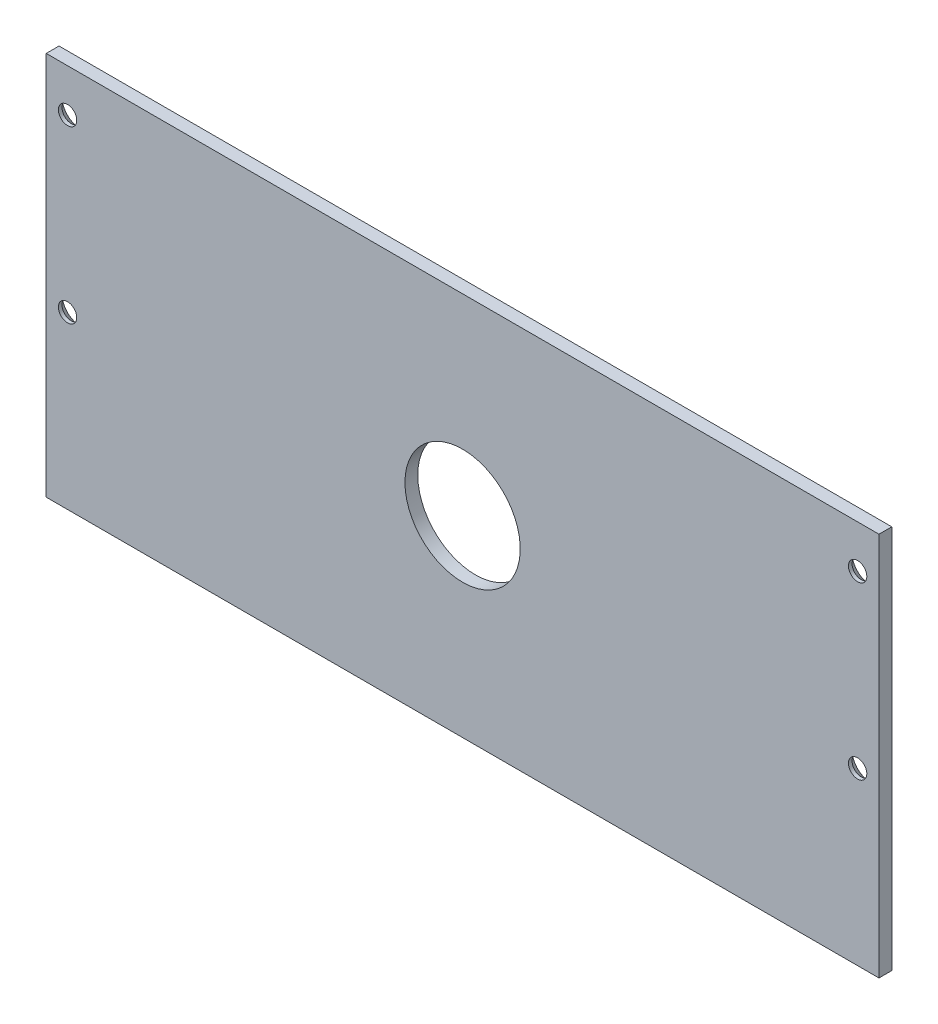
ISO-10303-21;
HEADER;
FILE_DESCRIPTION(('STEP AP214'),'2;1');
FILE_NAME('part.step','',(''),(''),'','','');
FILE_SCHEMA(('AUTOMOTIVE_DESIGN { 1 0 10303 214 1 1 1 1 }'));
ENDSEC;
DATA;
#1=APPLICATION_CONTEXT('core data for automotive mechanical design processes');
#2=APPLICATION_PROTOCOL_DEFINITION('international standard','automotive_design',2000,#1);
#3=PRODUCT_CONTEXT('',#1,'mechanical');
#4=PRODUCT('Part','Part','',(#3));
#5=PRODUCT_RELATED_PRODUCT_CATEGORY('part','',(#4));
#6=PRODUCT_DEFINITION_FORMATION('','',#4);
#7=PRODUCT_DEFINITION_CONTEXT('part definition',#1,'design');
#8=PRODUCT_DEFINITION('design','',#6,#7);
#9=PRODUCT_DEFINITION_SHAPE('','',#8);
#10=(LENGTH_UNIT() NAMED_UNIT(*) SI_UNIT(.MILLI.,.METRE.));
#11=(NAMED_UNIT(*) PLANE_ANGLE_UNIT() SI_UNIT($,.RADIAN.));
#12=(NAMED_UNIT(*) SI_UNIT($,.STERADIAN.) SOLID_ANGLE_UNIT());
#13=UNCERTAINTY_MEASURE_WITH_UNIT(LENGTH_MEASURE(1.E-05),#10,'distance_accuracy_value','');
#14=(GEOMETRIC_REPRESENTATION_CONTEXT(3) GLOBAL_UNCERTAINTY_ASSIGNED_CONTEXT((#13)) GLOBAL_UNIT_ASSIGNED_CONTEXT((#10,
#11,#12)) REPRESENTATION_CONTEXT('',''));
#15=CARTESIAN_POINT('',(0.,0.,0.));
#16=DIRECTION('',(0.,0.,1.));
#17=DIRECTION('',(1.,0.,0.));
#18=AXIS2_PLACEMENT_3D('',#15,#16,#17);
#19=CARTESIAN_POINT('',(-6.10622663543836E-13,5.48339151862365E-09,3.00000000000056));
#20=DIRECTION('',(1.,0.,0.));
#21=DIRECTION('',(0.,0.,-1.));
#22=AXIS2_PLACEMENT_3D('',#19,#20,#21);
#23=PLANE('',#22);
#24=DIRECTION('',(0.,-1.,0.));
#25=VECTOR('',#24,1.);
#26=CARTESIAN_POINT('',(-7.7715611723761E-13,5.4820592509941E-09,4.44089209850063E-13));
#27=LINE('',#26,#25);
#28=CARTESIAN_POINT('',(-4.44089209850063E-13,90.0000000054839,8.88178419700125E-13));
#29=VERTEX_POINT('',#28);
#30=CARTESIAN_POINT('',(-7.7715611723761E-13,5.4820592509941E-09,4.44089209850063E-13));
#31=VERTEX_POINT('',#30);
#32=EDGE_CURVE('E100',#29,#31,#27,.T.);
#33=ORIENTED_EDGE('',*,*,#32,.T.);
#34=DIRECTION('',(0.,0.,-1.));
#35=VECTOR('',#34,1.);
#36=CARTESIAN_POINT('',(-6.10622663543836E-13,5.48339151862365E-09,3.00000000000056));
#37=LINE('',#36,#35);
#38=CARTESIAN_POINT('',(-6.10622663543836E-13,5.48339151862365E-09,3.00000000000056));
#39=VERTEX_POINT('',#38);
#40=EDGE_CURVE('E11',#39,#31,#37,.T.);
#41=ORIENTED_EDGE('',*,*,#40,.F.);
#42=DIRECTION('',(0.,-1.,0.));
#43=VECTOR('',#42,1.);
#44=CARTESIAN_POINT('',(-6.10622663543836E-13,5.48339151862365E-09,3.00000000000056));
#45=LINE('',#44,#43);
#46=CARTESIAN_POINT('',(-2.22044604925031E-13,90.0000000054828,3.00000000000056));
#47=VERTEX_POINT('',#46);
#48=EDGE_CURVE('E88',#47,#39,#45,.T.);
#49=ORIENTED_EDGE('',*,*,#48,.F.);
#50=DIRECTION('',(0.,0.,-1.));
#51=VECTOR('',#50,1.);
#52=CARTESIAN_POINT('',(-2.22044604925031E-13,90.0000000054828,3.00000000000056));
#53=LINE('',#52,#51);
#54=EDGE_CURVE('E96',#47,#29,#53,.T.);
#55=ORIENTED_EDGE('',*,*,#54,.T.);
#56=EDGE_LOOP('',(#33,#41,#49,#55));
#57=FACE_BOUND('',#56,.T.);
#58=ADVANCED_FACE('F36',(#57),#23,.F.);
#59=CARTESIAN_POINT('',(-6.10622663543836E-13,5.48339151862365E-09,3.00000000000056));
#60=DIRECTION('',(0.,1.,0.));
#61=DIRECTION('',(0.,0.,1.));
#62=AXIS2_PLACEMENT_3D('',#59,#60,#61);
#63=PLANE('',#62);
#64=DIRECTION('',(1.,0.,0.));
#65=VECTOR('',#64,1.);
#66=CARTESIAN_POINT('',(-7.7715611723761E-13,5.4820592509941E-09,4.44089209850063E-13));
#67=LINE('',#66,#65);
#68=CARTESIAN_POINT('',(195.,5.48250334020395E-09,4.44089209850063E-13));
#69=VERTEX_POINT('',#68);
#70=EDGE_CURVE('E92',#31,#69,#67,.T.);
#71=ORIENTED_EDGE('',*,*,#70,.T.);
#72=DIRECTION('',(0.,0.,-1.));
#73=VECTOR('',#72,1.);
#74=CARTESIAN_POINT('',(195.,5.48272538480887E-09,2.99999999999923));
#75=LINE('',#74,#73);
#76=CARTESIAN_POINT('',(195.,5.48272538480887E-09,2.99999999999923));
#77=VERTEX_POINT('',#76);
#78=EDGE_CURVE('E45',#77,#69,#75,.T.);
#79=ORIENTED_EDGE('',*,*,#78,.F.);
#80=DIRECTION('',(1.,0.,0.));
#81=VECTOR('',#80,1.);
#82=CARTESIAN_POINT('',(-6.10622663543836E-13,5.48339151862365E-09,3.00000000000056));
#83=LINE('',#82,#81);
#84=EDGE_CURVE('E83',#39,#77,#83,.T.);
#85=ORIENTED_EDGE('',*,*,#84,.F.);
#86=ORIENTED_EDGE('',*,*,#40,.T.);
#87=EDGE_LOOP('',(#71,#79,#85,#86));
#88=FACE_BOUND('',#87,.T.);
#89=ADVANCED_FACE('F91',(#88),#63,.F.);
#90=CARTESIAN_POINT('',(195.,5.48272538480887E-09,2.99999999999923));
#91=DIRECTION('',(-1.,0.,0.));
#92=DIRECTION('',(0.,0.,1.));
#93=AXIS2_PLACEMENT_3D('',#90,#91,#92);
#94=PLANE('',#93);
#95=DIRECTION('',(0.,1.,0.));
#96=VECTOR('',#95,1.);
#97=CARTESIAN_POINT('',(195.,5.48250334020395E-09,4.44089209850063E-13));
#98=LINE('',#97,#96);
#99=CARTESIAN_POINT('',(195.,90.0000000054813,0.));
#100=VERTEX_POINT('',#99);
#101=EDGE_CURVE('E70',#69,#100,#98,.T.);
#102=ORIENTED_EDGE('',*,*,#101,.T.);
#103=DIRECTION('',(0.,0.,-1.));
#104=VECTOR('',#103,1.);
#105=CARTESIAN_POINT('',(195.,90.0000000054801,3.000000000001));
#106=LINE('',#105,#104);
#107=CARTESIAN_POINT('',(195.,90.0000000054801,3.000000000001));
#108=VERTEX_POINT('',#107);
#109=EDGE_CURVE('E93',#108,#100,#106,.T.);
#110=ORIENTED_EDGE('',*,*,#109,.F.);
#111=DIRECTION('',(0.,1.,0.));
#112=VECTOR('',#111,1.);
#113=CARTESIAN_POINT('',(195.,5.48272538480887E-09,2.99999999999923));
#114=LINE('',#113,#112);
#115=EDGE_CURVE('E86',#77,#108,#114,.T.);
#116=ORIENTED_EDGE('',*,*,#115,.F.);
#117=ORIENTED_EDGE('',*,*,#78,.T.);
#118=EDGE_LOOP('',(#102,#110,#116,#117));
#119=FACE_BOUND('',#118,.T.);
#120=ADVANCED_FACE('F94',(#119),#94,.F.);
#121=CARTESIAN_POINT('',(-2.22044604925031E-13,90.0000000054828,3.00000000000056));
#122=DIRECTION('',(0.,-1.,0.));
#123=DIRECTION('',(0.,0.,-1.));
#124=AXIS2_PLACEMENT_3D('',#121,#122,#123);
#125=PLANE('',#124);
#126=DIRECTION('',(-1.,0.,0.));
#127=VECTOR('',#126,1.);
#128=CARTESIAN_POINT('',(-4.44089209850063E-13,90.0000000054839,8.88178419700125E-13));
#129=LINE('',#128,#127);
#130=EDGE_CURVE('E76',#100,#29,#129,.T.);
#131=ORIENTED_EDGE('',*,*,#130,.T.);
#132=ORIENTED_EDGE('',*,*,#54,.F.);
#133=DIRECTION('',(-1.,0.,0.));
#134=VECTOR('',#133,1.);
#135=CARTESIAN_POINT('',(-2.22044604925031E-13,90.0000000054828,3.00000000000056));
#136=LINE('',#135,#134);
#137=EDGE_CURVE('E53',#108,#47,#136,.T.);
#138=ORIENTED_EDGE('',*,*,#137,.F.);
#139=ORIENTED_EDGE('',*,*,#109,.T.);
#140=EDGE_LOOP('',(#131,#132,#138,#139));
#141=FACE_BOUND('',#140,.T.);
#142=ADVANCED_FACE('F108',(#141),#125,.F.);
#143=CARTESIAN_POINT('',(-6.10622663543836E-13,5.48339151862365E-09,3.00000000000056));
#144=DIRECTION('',(0.,0.,-1.));
#145=DIRECTION('',(-1.,0.,0.));
#146=AXIS2_PLACEMENT_3D('',#143,#144,#145);
#147=PLANE('',#146);
#148=CARTESIAN_POINT('',(97.4999999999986,45.0000000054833,3.00000000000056));
#149=DIRECTION('',(0.,0.,-1.));
#150=DIRECTION('',(-1.,0.,0.));
#151=AXIS2_PLACEMENT_3D('',#148,#149,#150);
#152=CIRCLE('',#151,13.5);
#153=CARTESIAN_POINT('',(83.9999999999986,45.0000000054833,3.00000000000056));
#154=VERTEX_POINT('',#153);
#155=EDGE_CURVE('E147',#154,#154,#152,.T.);
#156=ORIENTED_EDGE('',*,*,#155,.T.);
#157=EDGE_LOOP('',(#156));
#158=FACE_BOUND('',#157,.T.);
#159=CARTESIAN_POINT('',(4.99999999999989,40.0000000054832,3.00000000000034));
#160=DIRECTION('',(0.,0.,-1.));
#161=DIRECTION('',(-1.,0.,0.));
#162=AXIS2_PLACEMENT_3D('',#159,#160,#161);
#163=CIRCLE('',#162,2.15);
#164=CARTESIAN_POINT('',(2.84999999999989,40.0000000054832,3.00000000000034));
#165=VERTEX_POINT('',#164);
#166=EDGE_CURVE('E141',#165,#165,#163,.T.);
#167=ORIENTED_EDGE('',*,*,#166,.T.);
#168=EDGE_LOOP('',(#167));
#169=FACE_BOUND('',#168,.T.);
#170=CARTESIAN_POINT('',(4.99999999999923,80.0000000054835,3.00000000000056));
#171=DIRECTION('',(0.,0.,-1.));
#172=DIRECTION('',(-1.,0.,0.));
#173=AXIS2_PLACEMENT_3D('',#170,#171,#172);
#174=CIRCLE('',#173,2.15);
#175=CARTESIAN_POINT('',(2.84999999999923,80.0000000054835,3.00000000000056));
#176=VERTEX_POINT('',#175);
#177=EDGE_CURVE('E135',#176,#176,#174,.T.);
#178=ORIENTED_EDGE('',*,*,#177,.T.);
#179=EDGE_LOOP('',(#178));
#180=FACE_BOUND('',#179,.T.);
#181=CARTESIAN_POINT('',(190.,40.0000000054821,3.00000000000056));
#182=DIRECTION('',(0.,0.,-1.));
#183=DIRECTION('',(-1.,0.,0.));
#184=AXIS2_PLACEMENT_3D('',#181,#182,#183);
#185=CIRCLE('',#184,2.15000000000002);
#186=CARTESIAN_POINT('',(187.85,40.0000000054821,3.00000000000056));
#187=VERTEX_POINT('',#186);
#188=EDGE_CURVE('E129',#187,#187,#185,.T.);
#189=ORIENTED_EDGE('',*,*,#188,.T.);
#190=EDGE_LOOP('',(#189));
#191=FACE_BOUND('',#190,.T.);
#192=CARTESIAN_POINT('',(190.,80.0000000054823,3.00000000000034));
#193=DIRECTION('',(0.,0.,-1.));
#194=DIRECTION('',(-1.,0.,0.));
#195=AXIS2_PLACEMENT_3D('',#192,#193,#194);
#196=CIRCLE('',#195,2.14999999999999);
#197=CARTESIAN_POINT('',(187.85,80.0000000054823,3.00000000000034));
#198=VERTEX_POINT('',#197);
#199=EDGE_CURVE('E121',#198,#198,#196,.T.);
#200=ORIENTED_EDGE('',*,*,#199,.T.);
#201=EDGE_LOOP('',(#200));
#202=FACE_BOUND('',#201,.T.);
#203=ORIENTED_EDGE('',*,*,#48,.T.);
#204=ORIENTED_EDGE('',*,*,#84,.T.);
#205=ORIENTED_EDGE('',*,*,#115,.T.);
#206=ORIENTED_EDGE('',*,*,#137,.T.);
#207=EDGE_LOOP('',(#203,#204,#205,#206));
#208=FACE_BOUND('',#207,.T.);
#209=ADVANCED_FACE('F84',(#158,#169,#180,#191,#202,#208),#147,.F.);
#210=CARTESIAN_POINT('',(-7.7715611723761E-13,5.4820592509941E-09,4.44089209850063E-13));
#211=DIRECTION('',(0.,0.,-1.));
#212=DIRECTION('',(-1.,0.,0.));
#213=AXIS2_PLACEMENT_3D('',#210,#211,#212);
#214=PLANE('',#213);
#215=CARTESIAN_POINT('',(97.4999999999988,45.0000000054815,1.11022302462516E-12));
#216=DIRECTION('',(0.,0.,-1.));
#217=DIRECTION('',(-1.,0.,0.));
#218=AXIS2_PLACEMENT_3D('',#215,#216,#217);
#219=CIRCLE('',#218,13.5);
#220=CARTESIAN_POINT('',(83.9999999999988,45.0000000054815,1.11022302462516E-12));
#221=VERTEX_POINT('',#220);
#222=EDGE_CURVE('E150',#221,#221,#219,.T.);
#223=ORIENTED_EDGE('',*,*,#222,.F.);
#224=EDGE_LOOP('',(#223));
#225=FACE_BOUND('',#224,.T.);
#226=CARTESIAN_POINT('',(4.99999999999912,80.0000000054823,0.));
#227=DIRECTION('',(0.,0.,-1.));
#228=DIRECTION('',(-1.,0.,0.));
#229=AXIS2_PLACEMENT_3D('',#226,#227,#228);
#230=CIRCLE('',#229,4.3);
#231=CARTESIAN_POINT('',(0.699999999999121,80.0000000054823,0.));
#232=VERTEX_POINT('',#231);
#233=EDGE_CURVE('E117',#232,#232,#230,.T.);
#234=ORIENTED_EDGE('',*,*,#233,.F.);
#235=EDGE_LOOP('',(#234));
#236=FACE_BOUND('',#235,.T.);
#237=CARTESIAN_POINT('',(189.999999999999,40.0000000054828,0.));
#238=DIRECTION('',(0.,0.,-1.));
#239=DIRECTION('',(-1.,0.,0.));
#240=AXIS2_PLACEMENT_3D('',#237,#238,#239);
#241=CIRCLE('',#240,4.3);
#242=CARTESIAN_POINT('',(185.699999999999,40.0000000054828,0.));
#243=VERTEX_POINT('',#242);
#244=EDGE_CURVE('E120',#243,#243,#241,.T.);
#245=ORIENTED_EDGE('',*,*,#244,.F.);
#246=EDGE_LOOP('',(#245));
#247=FACE_BOUND('',#246,.T.);
#248=CARTESIAN_POINT('',(4.99999999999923,40.0000000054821,4.44089209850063E-13));
#249=DIRECTION('',(0.,0.,-1.));
#250=DIRECTION('',(-1.,0.,0.));
#251=AXIS2_PLACEMENT_3D('',#248,#249,#250);
#252=CIRCLE('',#251,4.3);
#253=CARTESIAN_POINT('',(0.699999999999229,40.0000000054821,4.44089209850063E-13));
#254=VERTEX_POINT('',#253);
#255=EDGE_CURVE('E116',#254,#254,#252,.T.);
#256=ORIENTED_EDGE('',*,*,#255,.F.);
#257=EDGE_LOOP('',(#256));
#258=FACE_BOUND('',#257,.T.);
#259=CARTESIAN_POINT('',(190.,80.0000000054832,0.));
#260=DIRECTION('',(0.,0.,-1.));
#261=DIRECTION('',(-1.,0.,0.));
#262=AXIS2_PLACEMENT_3D('',#259,#260,#261);
#263=CIRCLE('',#262,4.3);
#264=CARTESIAN_POINT('',(185.7,80.0000000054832,0.));
#265=VERTEX_POINT('',#264);
#266=EDGE_CURVE('E103',#265,#265,#263,.T.);
#267=ORIENTED_EDGE('',*,*,#266,.F.);
#268=EDGE_LOOP('',(#267));
#269=FACE_BOUND('',#268,.T.);
#270=ORIENTED_EDGE('',*,*,#32,.F.);
#271=ORIENTED_EDGE('',*,*,#130,.F.);
#272=ORIENTED_EDGE('',*,*,#101,.F.);
#273=ORIENTED_EDGE('',*,*,#70,.F.);
#274=EDGE_LOOP('',(#270,#271,#272,#273));
#275=FACE_BOUND('',#274,.T.);
#276=ADVANCED_FACE('F111',(#225,#236,#247,#258,#269,#275),#214,.T.);
#277=CARTESIAN_POINT('',(190.,80.0000000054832,0.));
#278=DIRECTION('',(0.,0.,-1.));
#279=DIRECTION('',(-1.,0.,0.));
#280=AXIS2_PLACEMENT_3D('',#277,#278,#279);
#281=CONICAL_SURFACE('',#280,4.3,0.78539816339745);
#282=CARTESIAN_POINT('',(189.999999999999,80.0000000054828,2.15000000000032));
#283=DIRECTION('',(0.,0.,-1.));
#284=DIRECTION('',(-1.,0.,0.));
#285=AXIS2_PLACEMENT_3D('',#282,#283,#284);
#286=CIRCLE('',#285,2.14999999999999);
#287=CARTESIAN_POINT('',(187.849999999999,80.0000000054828,2.15000000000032));
#288=VERTEX_POINT('',#287);
#289=EDGE_CURVE('E126',#288,#288,#286,.T.);
#290=ORIENTED_EDGE('',*,*,#289,.F.);
#291=EDGE_LOOP('',(#290));
#292=FACE_BOUND('',#291,.T.);
#293=ORIENTED_EDGE('',*,*,#266,.T.);
#294=EDGE_LOOP('',(#293));
#295=FACE_BOUND('',#294,.T.);
#296=ADVANCED_FACE('F38',(#292,#295),#281,.F.);
#297=CARTESIAN_POINT('',(4.99999999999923,40.0000000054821,4.44089209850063E-13));
#298=DIRECTION('',(0.,0.,-1.));
#299=DIRECTION('',(-1.,0.,0.));
#300=AXIS2_PLACEMENT_3D('',#297,#298,#299);
#301=CONICAL_SURFACE('',#300,4.3,0.78539816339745);
#302=CARTESIAN_POINT('',(4.99999999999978,40.0000000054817,2.14999999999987));
#303=DIRECTION('',(0.,0.,-1.));
#304=DIRECTION('',(-1.,0.,0.));
#305=AXIS2_PLACEMENT_3D('',#302,#303,#304);
#306=CIRCLE('',#305,2.15);
#307=CARTESIAN_POINT('',(2.84999999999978,40.0000000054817,2.14999999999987));
#308=VERTEX_POINT('',#307);
#309=EDGE_CURVE('E144',#308,#308,#306,.T.);
#310=ORIENTED_EDGE('',*,*,#309,.F.);
#311=EDGE_LOOP('',(#310));
#312=FACE_BOUND('',#311,.T.);
#313=ORIENTED_EDGE('',*,*,#255,.T.);
#314=EDGE_LOOP('',(#313));
#315=FACE_BOUND('',#314,.T.);
#316=ADVANCED_FACE('F177',(#312,#315),#301,.F.);
#317=CARTESIAN_POINT('',(189.999999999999,40.0000000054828,0.));
#318=DIRECTION('',(0.,0.,-1.));
#319=DIRECTION('',(-1.,0.,0.));
#320=AXIS2_PLACEMENT_3D('',#317,#318,#319);
#321=CONICAL_SURFACE('',#320,4.3,0.78539816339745);
#322=CARTESIAN_POINT('',(190.,40.0000000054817,2.14999999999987));
#323=DIRECTION('',(0.,0.,-1.));
#324=DIRECTION('',(-1.,0.,0.));
#325=AXIS2_PLACEMENT_3D('',#322,#323,#324);
#326=CIRCLE('',#325,2.15000000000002);
#327=CARTESIAN_POINT('',(187.85,40.0000000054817,2.14999999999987));
#328=VERTEX_POINT('',#327);
#329=EDGE_CURVE('E132',#328,#328,#326,.T.);
#330=ORIENTED_EDGE('',*,*,#329,.F.);
#331=EDGE_LOOP('',(#330));
#332=FACE_BOUND('',#331,.T.);
#333=ORIENTED_EDGE('',*,*,#244,.T.);
#334=EDGE_LOOP('',(#333));
#335=FACE_BOUND('',#334,.T.);
#336=ADVANCED_FACE('F182',(#332,#335),#321,.F.);
#337=CARTESIAN_POINT('',(4.99999999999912,80.0000000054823,0.));
#338=DIRECTION('',(0.,0.,-1.));
#339=DIRECTION('',(-1.,0.,0.));
#340=AXIS2_PLACEMENT_3D('',#337,#338,#339);
#341=CONICAL_SURFACE('',#340,4.3,0.78539816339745);
#342=CARTESIAN_POINT('',(4.99999999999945,80.0000000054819,2.15000000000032));
#343=DIRECTION('',(0.,0.,-1.));
#344=DIRECTION('',(-1.,0.,0.));
#345=AXIS2_PLACEMENT_3D('',#342,#343,#344);
#346=CIRCLE('',#345,2.15);
#347=CARTESIAN_POINT('',(2.84999999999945,80.0000000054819,2.15000000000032));
#348=VERTEX_POINT('',#347);
#349=EDGE_CURVE('E138',#348,#348,#346,.T.);
#350=ORIENTED_EDGE('',*,*,#349,.F.);
#351=EDGE_LOOP('',(#350));
#352=FACE_BOUND('',#351,.T.);
#353=ORIENTED_EDGE('',*,*,#233,.T.);
#354=EDGE_LOOP('',(#353));
#355=FACE_BOUND('',#354,.T.);
#356=ADVANCED_FACE('F194',(#352,#355),#341,.F.);
#357=CARTESIAN_POINT('',(190.,80.0000000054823,3.00000000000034));
#358=DIRECTION('',(0.,0.,-1.));
#359=DIRECTION('',(-1.,0.,0.));
#360=AXIS2_PLACEMENT_3D('',#357,#358,#359);
#361=CYLINDRICAL_SURFACE('',#360,2.14999999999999);
#362=ORIENTED_EDGE('',*,*,#199,.F.);
#363=EDGE_LOOP('',(#362));
#364=FACE_BOUND('',#363,.T.);
#365=ORIENTED_EDGE('',*,*,#289,.T.);
#366=EDGE_LOOP('',(#365));
#367=FACE_BOUND('',#366,.T.);
#368=ADVANCED_FACE('F196',(#364,#367),#361,.F.);
#369=CARTESIAN_POINT('',(190.,40.0000000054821,3.00000000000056));
#370=DIRECTION('',(0.,0.,-1.));
#371=DIRECTION('',(-1.,0.,0.));
#372=AXIS2_PLACEMENT_3D('',#369,#370,#371);
#373=CYLINDRICAL_SURFACE('',#372,2.15000000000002);
#374=ORIENTED_EDGE('',*,*,#188,.F.);
#375=EDGE_LOOP('',(#374));
#376=FACE_BOUND('',#375,.T.);
#377=ORIENTED_EDGE('',*,*,#329,.T.);
#378=EDGE_LOOP('',(#377));
#379=FACE_BOUND('',#378,.T.);
#380=ADVANCED_FACE('F205',(#376,#379),#373,.F.);
#381=CARTESIAN_POINT('',(4.99999999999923,80.0000000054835,3.00000000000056));
#382=DIRECTION('',(0.,0.,-1.));
#383=DIRECTION('',(-1.,0.,0.));
#384=AXIS2_PLACEMENT_3D('',#381,#382,#383);
#385=CYLINDRICAL_SURFACE('',#384,2.15);
#386=ORIENTED_EDGE('',*,*,#177,.F.);
#387=EDGE_LOOP('',(#386));
#388=FACE_BOUND('',#387,.T.);
#389=ORIENTED_EDGE('',*,*,#349,.T.);
#390=EDGE_LOOP('',(#389));
#391=FACE_BOUND('',#390,.T.);
#392=ADVANCED_FACE('F207',(#388,#391),#385,.F.);
#393=CARTESIAN_POINT('',(4.99999999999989,40.0000000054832,3.00000000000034));
#394=DIRECTION('',(0.,0.,-1.));
#395=DIRECTION('',(-1.,0.,0.));
#396=AXIS2_PLACEMENT_3D('',#393,#394,#395);
#397=CYLINDRICAL_SURFACE('',#396,2.15);
#398=ORIENTED_EDGE('',*,*,#166,.F.);
#399=EDGE_LOOP('',(#398));
#400=FACE_BOUND('',#399,.T.);
#401=ORIENTED_EDGE('',*,*,#309,.T.);
#402=EDGE_LOOP('',(#401));
#403=FACE_BOUND('',#402,.T.);
#404=ADVANCED_FACE('F161',(#400,#403),#397,.F.);
#405=CARTESIAN_POINT('',(97.4999999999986,45.0000000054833,3.00000000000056));
#406=DIRECTION('',(0.,0.,-1.));
#407=DIRECTION('',(-1.,0.,0.));
#408=AXIS2_PLACEMENT_3D('',#405,#406,#407);
#409=CYLINDRICAL_SURFACE('',#408,13.5);
#410=ORIENTED_EDGE('',*,*,#155,.F.);
#411=EDGE_LOOP('',(#410));
#412=FACE_BOUND('',#411,.T.);
#413=ORIENTED_EDGE('',*,*,#222,.T.);
#414=EDGE_LOOP('',(#413));
#415=FACE_BOUND('',#414,.T.);
#416=ADVANCED_FACE('F158',(#412,#415),#409,.F.);
#417=CLOSED_SHELL('',(#58,#89,#120,#142,#209,#276,#296,#316,#336,#356,#368,#380,#392,#404,#416));
#418=MANIFOLD_SOLID_BREP('B2',#417);
#419=ADVANCED_BREP_SHAPE_REPRESENTATION('',(#18,#418),#14);
#420=SHAPE_DEFINITION_REPRESENTATION(#9,#419);
ENDSEC;
END-ISO-10303-21;
